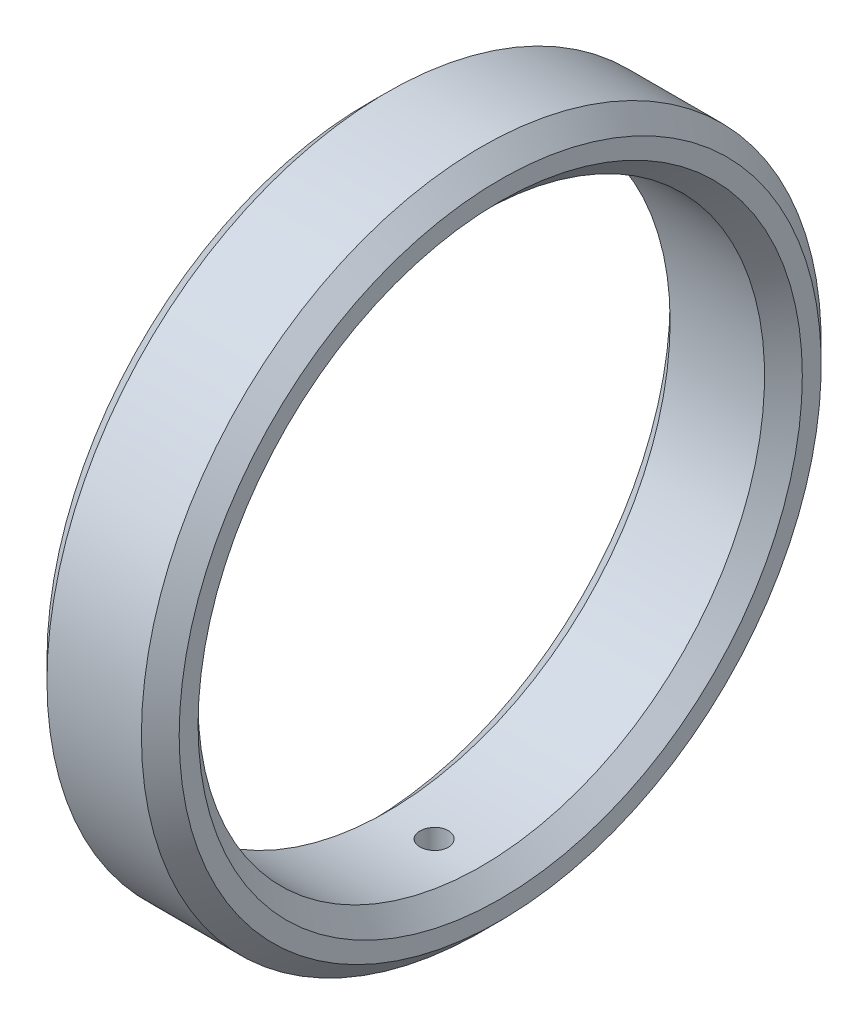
from build123d import *

# Parameters (mm, degrees)
ESQUISSE2_R             = 15
ENL_V_MAT_EXTRU_1_DEPTH = 27.400757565
CHANFREIN1_SIZE         = 1
ESQUISSE3_R             = 0.75
ENL_V_MAT_EXTRU_2_DEPTH = 20


with BuildPart() as part:
    # Esquisse1 → Base-R_volution (revolve)
    with BuildSketch(Plane.XY, mode=Mode.PRIVATE) as base_r_volution_sk:
        Polygon((-18.994686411, 17), (-18.994686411, 0), (-11.994686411, 0), (-11.994686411, 17), (-12.994686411, 18), (-17.994686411, 18), align=None)
    revolve(base_r_volution_sk.sketch.rotate(Axis((-47.204616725, 0, 0), (1, 0, 0)), 90), axis=Axis((-47.204616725, 0, 0), (1, 0, 0)))

    # Esquisse2 → Enl_v. mat.-Extru.1 (cut, through all)
    with BuildSketch(Plane.ZY.offset(18.994686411)):
        Circle(ESQUISSE2_R)
    extrude(amount=-ENL_V_MAT_EXTRU_1_DEPTH, mode=Mode.SUBTRACT)

    # Chanfrein1
    chanfrein1_edges = [part.edges().sort_by_distance(p)[0] for p in [
        (-18.994686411, 0, -15),
        (-11.994686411, 0, -15),
    ]]
    chamfer(chanfrein1_edges, length=CHANFREIN1_SIZE)

    # Esquisse3 → Enl_v. mat.-Extru.2 (cut)
    with BuildSketch(Plane(origin=(0, 0, 0), x_dir=(1, 0, 0), z_dir=(0, 1, 0))):
        with Locations(Location((-15.494686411, 0, 0), (0, 0, 270))):
            Circle(ESQUISSE3_R)
    extrude(amount=-ENL_V_MAT_EXTRU_2_DEPTH, mode=Mode.SUBTRACT)


solid = part.part
